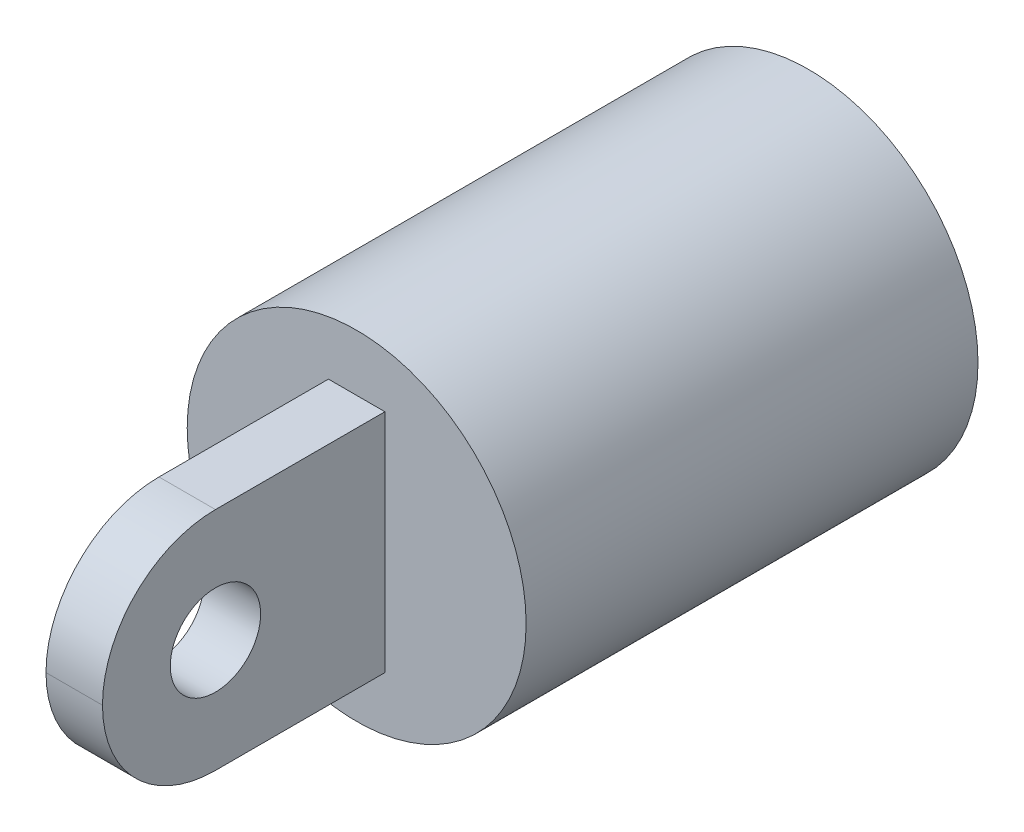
ISO-10303-21;
HEADER;
FILE_DESCRIPTION(('STEP AP214'),'2;1');
FILE_NAME('part.step','',(''),(''),'','','');
FILE_SCHEMA(('AUTOMOTIVE_DESIGN { 1 0 10303 214 1 1 1 1 }'));
ENDSEC;
DATA;
#1=APPLICATION_CONTEXT('core data for automotive mechanical design processes');
#2=APPLICATION_PROTOCOL_DEFINITION('international standard','automotive_design',2000,#1);
#3=PRODUCT_CONTEXT('',#1,'mechanical');
#4=PRODUCT('Part','Part','',(#3));
#5=PRODUCT_RELATED_PRODUCT_CATEGORY('part','',(#4));
#6=PRODUCT_DEFINITION_FORMATION('','',#4);
#7=PRODUCT_DEFINITION_CONTEXT('part definition',#1,'design');
#8=PRODUCT_DEFINITION('design','',#6,#7);
#9=PRODUCT_DEFINITION_SHAPE('','',#8);
#10=(LENGTH_UNIT() NAMED_UNIT(*) SI_UNIT(.MILLI.,.METRE.));
#11=(NAMED_UNIT(*) PLANE_ANGLE_UNIT() SI_UNIT($,.RADIAN.));
#12=(NAMED_UNIT(*) SI_UNIT($,.STERADIAN.) SOLID_ANGLE_UNIT());
#13=UNCERTAINTY_MEASURE_WITH_UNIT(LENGTH_MEASURE(1.E-05),#10,'distance_accuracy_value','');
#14=(GEOMETRIC_REPRESENTATION_CONTEXT(3) GLOBAL_UNCERTAINTY_ASSIGNED_CONTEXT((#13)) GLOBAL_UNIT_ASSIGNED_CONTEXT((#10,
#11,#12)) REPRESENTATION_CONTEXT('',''));
#15=CARTESIAN_POINT('',(0.,0.,0.));
#16=DIRECTION('',(0.,0.,1.));
#17=DIRECTION('',(1.,0.,0.));
#18=AXIS2_PLACEMENT_3D('',#15,#16,#17);
#19=CARTESIAN_POINT('',(0.,0.,40.));
#20=DIRECTION('',(0.,0.,-1.));
#21=DIRECTION('',(-1.,0.,0.));
#22=AXIS2_PLACEMENT_3D('',#19,#20,#21);
#23=CYLINDRICAL_SURFACE('',#22,15.);
#24=CARTESIAN_POINT('',(0.,0.,40.));
#25=DIRECTION('',(0.,0.,1.));
#26=DIRECTION('',(1.,0.,0.));
#27=AXIS2_PLACEMENT_3D('',#24,#25,#26);
#28=CIRCLE('',#27,15.);
#29=CARTESIAN_POINT('',(15.,0.,40.));
#30=VERTEX_POINT('',#29);
#31=EDGE_CURVE('E109',#30,#30,#28,.T.);
#32=ORIENTED_EDGE('',*,*,#31,.F.);
#33=EDGE_LOOP('',(#32));
#34=FACE_BOUND('',#33,.T.);
#35=CARTESIAN_POINT('',(0.,0.,0.));
#36=DIRECTION('',(0.,0.,1.));
#37=DIRECTION('',(1.,0.,0.));
#38=AXIS2_PLACEMENT_3D('',#35,#36,#37);
#39=CIRCLE('',#38,15.);
#40=CARTESIAN_POINT('',(15.,0.,0.));
#41=VERTEX_POINT('',#40);
#42=EDGE_CURVE('E108',#41,#41,#39,.T.);
#43=ORIENTED_EDGE('',*,*,#42,.T.);
#44=EDGE_LOOP('',(#43));
#45=FACE_BOUND('',#44,.T.);
#46=ADVANCED_FACE('F33',(#34,#45),#23,.T.);
#47=CARTESIAN_POINT('',(0.,0.,40.));
#48=DIRECTION('',(0.,0.,1.));
#49=DIRECTION('',(1.,0.,0.));
#50=AXIS2_PLACEMENT_3D('',#47,#48,#49);
#51=PLANE('',#50);
#52=DIRECTION('',(0.,-1.,0.));
#53=VECTOR('',#52,1.);
#54=CARTESIAN_POINT('',(-2.5,10.,40.));
#55=LINE('',#54,#53);
#56=CARTESIAN_POINT('',(-2.5,10.,40.));
#57=VERTEX_POINT('',#56);
#58=CARTESIAN_POINT('',(-2.5,-10.,40.));
#59=VERTEX_POINT('',#58);
#60=EDGE_CURVE('E98',#57,#59,#55,.T.);
#61=ORIENTED_EDGE('',*,*,#60,.F.);
#62=DIRECTION('',(-1.,0.,0.));
#63=VECTOR('',#62,1.);
#64=CARTESIAN_POINT('',(-2.5,10.,40.));
#65=LINE('',#64,#63);
#66=CARTESIAN_POINT('',(2.5,10.,40.));
#67=VERTEX_POINT('',#66);
#68=EDGE_CURVE('E94',#67,#57,#65,.T.);
#69=ORIENTED_EDGE('',*,*,#68,.F.);
#70=DIRECTION('',(0.,1.,0.));
#71=VECTOR('',#70,1.);
#72=CARTESIAN_POINT('',(2.5,10.,40.));
#73=LINE('',#72,#71);
#74=CARTESIAN_POINT('',(2.5,-10.,40.));
#75=VERTEX_POINT('',#74);
#76=EDGE_CURVE('E78',#75,#67,#73,.T.);
#77=ORIENTED_EDGE('',*,*,#76,.F.);
#78=DIRECTION('',(1.,0.,0.));
#79=VECTOR('',#78,1.);
#80=CARTESIAN_POINT('',(-2.5,-10.,40.));
#81=LINE('',#80,#79);
#82=EDGE_CURVE('E91',#59,#75,#81,.T.);
#83=ORIENTED_EDGE('',*,*,#82,.F.);
#84=EDGE_LOOP('',(#61,#69,#77,#83));
#85=FACE_BOUND('',#84,.T.);
#86=ORIENTED_EDGE('',*,*,#31,.T.);
#87=EDGE_LOOP('',(#86));
#88=FACE_BOUND('',#87,.T.);
#89=ADVANCED_FACE('F89',(#85,#88),#51,.T.);
#90=CARTESIAN_POINT('',(0.,0.,0.));
#91=DIRECTION('',(0.,0.,1.));
#92=DIRECTION('',(1.,0.,0.));
#93=AXIS2_PLACEMENT_3D('',#90,#91,#92);
#94=PLANE('',#93);
#95=CARTESIAN_POINT('',(0.,0.,0.));
#96=DIRECTION('',(0.,0.,-1.));
#97=DIRECTION('',(-1.,0.,0.));
#98=AXIS2_PLACEMENT_3D('',#95,#96,#97);
#99=CIRCLE('',#98,5.1);
#100=CARTESIAN_POINT('',(-5.1,0.,0.));
#101=VERTEX_POINT('',#100);
#102=EDGE_CURVE('E142',#101,#101,#99,.T.);
#103=ORIENTED_EDGE('',*,*,#102,.F.);
#104=EDGE_LOOP('',(#103));
#105=FACE_BOUND('',#104,.T.);
#106=ORIENTED_EDGE('',*,*,#42,.F.);
#107=EDGE_LOOP('',(#106));
#108=FACE_BOUND('',#107,.T.);
#109=ADVANCED_FACE('F157',(#105,#108),#94,.F.);
#110=CARTESIAN_POINT('',(-2.5,10.,65.));
#111=DIRECTION('',(1.,0.,0.));
#112=DIRECTION('',(0.,1.,0.));
#113=AXIS2_PLACEMENT_3D('',#110,#111,#112);
#114=PLANE('',#113);
#115=CARTESIAN_POINT('',(-2.5,0.,55.));
#116=DIRECTION('',(1.,0.,0.));
#117=DIRECTION('',(0.,1.,0.));
#118=AXIS2_PLACEMENT_3D('',#115,#116,#117);
#119=CIRCLE('',#118,4.00000000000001);
#120=CARTESIAN_POINT('',(-2.5,4.00000000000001,55.));
#121=VERTEX_POINT('',#120);
#122=EDGE_CURVE('E133',#121,#121,#119,.T.);
#123=ORIENTED_EDGE('',*,*,#122,.T.);
#124=EDGE_LOOP('',(#123));
#125=FACE_BOUND('',#124,.T.);
#126=CARTESIAN_POINT('',(-2.5,0.,55.));
#127=DIRECTION('',(1.,0.,0.));
#128=DIRECTION('',(0.,1.,0.));
#129=AXIS2_PLACEMENT_3D('',#126,#127,#128);
#130=CIRCLE('',#129,10.);
#131=CARTESIAN_POINT('',(-2.5,-10.,55.));
#132=VERTEX_POINT('',#131);
#133=CARTESIAN_POINT('',(-2.5,0.,65.));
#134=VERTEX_POINT('',#133);
#135=EDGE_CURVE('E112',#132,#134,#130,.F.);
#136=ORIENTED_EDGE('',*,*,#135,.T.);
#137=CARTESIAN_POINT('',(-2.5,0.,55.));
#138=DIRECTION('',(1.,0.,0.));
#139=DIRECTION('',(0.,1.,0.));
#140=AXIS2_PLACEMENT_3D('',#137,#138,#139);
#141=CIRCLE('',#140,10.);
#142=CARTESIAN_POINT('',(-2.5,10.,55.));
#143=VERTEX_POINT('',#142);
#144=EDGE_CURVE('E116',#134,#143,#141,.F.);
#145=ORIENTED_EDGE('',*,*,#144,.T.);
#146=DIRECTION('',(0.,0.,-1.));
#147=VECTOR('',#146,1.);
#148=CARTESIAN_POINT('',(-2.5,10.,65.));
#149=LINE('',#148,#147);
#150=EDGE_CURVE('E104',#143,#57,#149,.T.);
#151=ORIENTED_EDGE('',*,*,#150,.T.);
#152=ORIENTED_EDGE('',*,*,#60,.T.);
#153=DIRECTION('',(0.,0.,-1.));
#154=VECTOR('',#153,1.);
#155=CARTESIAN_POINT('',(-2.5,-10.,65.));
#156=LINE('',#155,#154);
#157=EDGE_CURVE('E82',#132,#59,#156,.T.);
#158=ORIENTED_EDGE('',*,*,#157,.F.);
#159=EDGE_LOOP('',(#136,#145,#151,#152,#158));
#160=FACE_BOUND('',#159,.T.);
#161=ADVANCED_FACE('F160',(#125,#160),#114,.F.);
#162=CARTESIAN_POINT('',(-2.5,-10.,65.));
#163=DIRECTION('',(0.,1.,0.));
#164=DIRECTION('',(0.,0.,1.));
#165=AXIS2_PLACEMENT_3D('',#162,#163,#164);
#166=PLANE('',#165);
#167=DIRECTION('',(0.,0.,-1.));
#168=VECTOR('',#167,1.);
#169=CARTESIAN_POINT('',(2.5,-10.,65.));
#170=LINE('',#169,#168);
#171=CARTESIAN_POINT('',(2.5,-10.,55.));
#172=VERTEX_POINT('',#171);
#173=EDGE_CURVE('E75',#172,#75,#170,.T.);
#174=ORIENTED_EDGE('',*,*,#173,.F.);
#175=DIRECTION('',(1.,0.,0.));
#176=VECTOR('',#175,1.);
#177=CARTESIAN_POINT('',(-2.5,-10.,55.));
#178=LINE('',#177,#176);
#179=EDGE_CURVE('E11',#172,#132,#178,.F.);
#180=ORIENTED_EDGE('',*,*,#179,.T.);
#181=ORIENTED_EDGE('',*,*,#157,.T.);
#182=ORIENTED_EDGE('',*,*,#82,.T.);
#183=EDGE_LOOP('',(#174,#180,#181,#182));
#184=FACE_BOUND('',#183,.T.);
#185=ADVANCED_FACE('F96',(#184),#166,.F.);
#186=CARTESIAN_POINT('',(2.5,10.,65.));
#187=DIRECTION('',(-1.,0.,0.));
#188=DIRECTION('',(0.,-1.,0.));
#189=AXIS2_PLACEMENT_3D('',#186,#187,#188);
#190=PLANE('',#189);
#191=CARTESIAN_POINT('',(2.5,0.,55.));
#192=DIRECTION('',(1.,0.,0.));
#193=DIRECTION('',(0.,1.,0.));
#194=AXIS2_PLACEMENT_3D('',#191,#192,#193);
#195=CIRCLE('',#194,4.00000000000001);
#196=CARTESIAN_POINT('',(2.5,4.00000000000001,55.));
#197=VERTEX_POINT('',#196);
#198=EDGE_CURVE('E135',#197,#197,#195,.T.);
#199=ORIENTED_EDGE('',*,*,#198,.F.);
#200=EDGE_LOOP('',(#199));
#201=FACE_BOUND('',#200,.T.);
#202=DIRECTION('',(0.,0.,-1.));
#203=VECTOR('',#202,1.);
#204=CARTESIAN_POINT('',(2.5,10.,65.));
#205=LINE('',#204,#203);
#206=CARTESIAN_POINT('',(2.5,10.,55.));
#207=VERTEX_POINT('',#206);
#208=EDGE_CURVE('E83',#207,#67,#205,.T.);
#209=ORIENTED_EDGE('',*,*,#208,.F.);
#210=CARTESIAN_POINT('',(2.5,0.,55.));
#211=DIRECTION('',(-1.,0.,0.));
#212=DIRECTION('',(0.,-1.,0.));
#213=AXIS2_PLACEMENT_3D('',#210,#211,#212);
#214=CIRCLE('',#213,10.);
#215=CARTESIAN_POINT('',(2.5,0.,65.));
#216=VERTEX_POINT('',#215);
#217=EDGE_CURVE('E42',#207,#216,#214,.F.);
#218=ORIENTED_EDGE('',*,*,#217,.T.);
#219=CARTESIAN_POINT('',(2.5,0.,55.));
#220=DIRECTION('',(-1.,0.,0.));
#221=DIRECTION('',(0.,-1.,0.));
#222=AXIS2_PLACEMENT_3D('',#219,#220,#221);
#223=CIRCLE('',#222,10.);
#224=EDGE_CURVE('E49',#216,#172,#223,.F.);
#225=ORIENTED_EDGE('',*,*,#224,.T.);
#226=ORIENTED_EDGE('',*,*,#173,.T.);
#227=ORIENTED_EDGE('',*,*,#76,.T.);
#228=EDGE_LOOP('',(#209,#218,#225,#226,#227));
#229=FACE_BOUND('',#228,.T.);
#230=ADVANCED_FACE('F77',(#201,#229),#190,.F.);
#231=CARTESIAN_POINT('',(-2.5,10.,65.));
#232=DIRECTION('',(0.,-1.,0.));
#233=DIRECTION('',(0.,0.,-1.));
#234=AXIS2_PLACEMENT_3D('',#231,#232,#233);
#235=PLANE('',#234);
#236=ORIENTED_EDGE('',*,*,#150,.F.);
#237=DIRECTION('',(-1.,0.,0.));
#238=VECTOR('',#237,1.);
#239=CARTESIAN_POINT('',(2.5,10.,55.));
#240=LINE('',#239,#238);
#241=EDGE_CURVE('E118',#143,#207,#240,.F.);
#242=ORIENTED_EDGE('',*,*,#241,.T.);
#243=ORIENTED_EDGE('',*,*,#208,.T.);
#244=ORIENTED_EDGE('',*,*,#68,.T.);
#245=EDGE_LOOP('',(#236,#242,#243,#244));
#246=FACE_BOUND('',#245,.T.);
#247=ADVANCED_FACE('F125',(#246),#235,.F.);
#248=CARTESIAN_POINT('',(0.,0.,55.));
#249=DIRECTION('',(-1.,0.,0.));
#250=DIRECTION('',(0.,0.,1.));
#251=AXIS2_PLACEMENT_3D('',#248,#249,#250);
#252=CYLINDRICAL_SURFACE('',#251,10.);
#253=ORIENTED_EDGE('',*,*,#179,.F.);
#254=ORIENTED_EDGE('',*,*,#224,.F.);
#255=DIRECTION('',(1.,0.,0.));
#256=VECTOR('',#255,1.);
#257=CARTESIAN_POINT('',(2.5,0.,65.));
#258=LINE('',#257,#256);
#259=EDGE_CURVE('E37',#134,#216,#258,.T.);
#260=ORIENTED_EDGE('',*,*,#259,.F.);
#261=ORIENTED_EDGE('',*,*,#135,.F.);
#262=EDGE_LOOP('',(#253,#254,#260,#261));
#263=FACE_BOUND('',#262,.T.);
#264=ADVANCED_FACE('F35',(#263),#252,.T.);
#265=CARTESIAN_POINT('',(0.,0.,55.));
#266=DIRECTION('',(1.,0.,0.));
#267=DIRECTION('',(0.,0.,-1.));
#268=AXIS2_PLACEMENT_3D('',#265,#266,#267);
#269=CYLINDRICAL_SURFACE('',#268,10.);
#270=ORIENTED_EDGE('',*,*,#217,.F.);
#271=ORIENTED_EDGE('',*,*,#241,.F.);
#272=ORIENTED_EDGE('',*,*,#144,.F.);
#273=ORIENTED_EDGE('',*,*,#259,.T.);
#274=EDGE_LOOP('',(#270,#271,#272,#273));
#275=FACE_BOUND('',#274,.T.);
#276=ADVANCED_FACE('F128',(#275),#269,.T.);
#277=CARTESIAN_POINT('',(-22.5,0.,55.));
#278=DIRECTION('',(1.,0.,0.));
#279=DIRECTION('',(0.,1.,0.));
#280=AXIS2_PLACEMENT_3D('',#277,#278,#279);
#281=CYLINDRICAL_SURFACE('',#280,4.00000000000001);
#282=ORIENTED_EDGE('',*,*,#198,.T.);
#283=EDGE_LOOP('',(#282));
#284=FACE_BOUND('',#283,.T.);
#285=ORIENTED_EDGE('',*,*,#122,.F.);
#286=EDGE_LOOP('',(#285));
#287=FACE_BOUND('',#286,.T.);
#288=ADVANCED_FACE('F153',(#284,#287),#281,.F.);
#289=CARTESIAN_POINT('',(0.,0.,30.));
#290=DIRECTION('',(0.,0.,-1.));
#291=DIRECTION('',(-1.,0.,0.));
#292=AXIS2_PLACEMENT_3D('',#289,#290,#291);
#293=CYLINDRICAL_SURFACE('',#292,5.1);
#294=CARTESIAN_POINT('',(0.,0.,30.));
#295=DIRECTION('',(0.,0.,-1.));
#296=DIRECTION('',(-1.,0.,0.));
#297=AXIS2_PLACEMENT_3D('',#294,#295,#296);
#298=CIRCLE('',#297,5.1);
#299=CARTESIAN_POINT('',(-5.1,0.,30.));
#300=VERTEX_POINT('',#299);
#301=EDGE_CURVE('E139',#300,#300,#298,.T.);
#302=ORIENTED_EDGE('',*,*,#301,.F.);
#303=EDGE_LOOP('',(#302));
#304=FACE_BOUND('',#303,.T.);
#305=ORIENTED_EDGE('',*,*,#102,.T.);
#306=EDGE_LOOP('',(#305));
#307=FACE_BOUND('',#306,.T.);
#308=ADVANCED_FACE('F150',(#304,#307),#293,.F.);
#309=CARTESIAN_POINT('',(0.,0.,30.));
#310=DIRECTION('',(0.,0.,-1.));
#311=DIRECTION('',(-1.,0.,0.));
#312=AXIS2_PLACEMENT_3D('',#309,#310,#311);
#313=PLANE('',#312);
#314=ORIENTED_EDGE('',*,*,#301,.T.);
#315=EDGE_LOOP('',(#314));
#316=FACE_BOUND('',#315,.T.);
#317=ADVANCED_FACE('F148',(#316),#313,.T.);
#318=CLOSED_SHELL('',(#46,#89,#109,#161,#185,#230,#247,#264,#276,#288,#308,#317));
#319=MANIFOLD_SOLID_BREP('B2',#318);
#320=ADVANCED_BREP_SHAPE_REPRESENTATION('',(#18,#319),#14);
#321=SHAPE_DEFINITION_REPRESENTATION(#9,#320);
ENDSEC;
END-ISO-10303-21;
